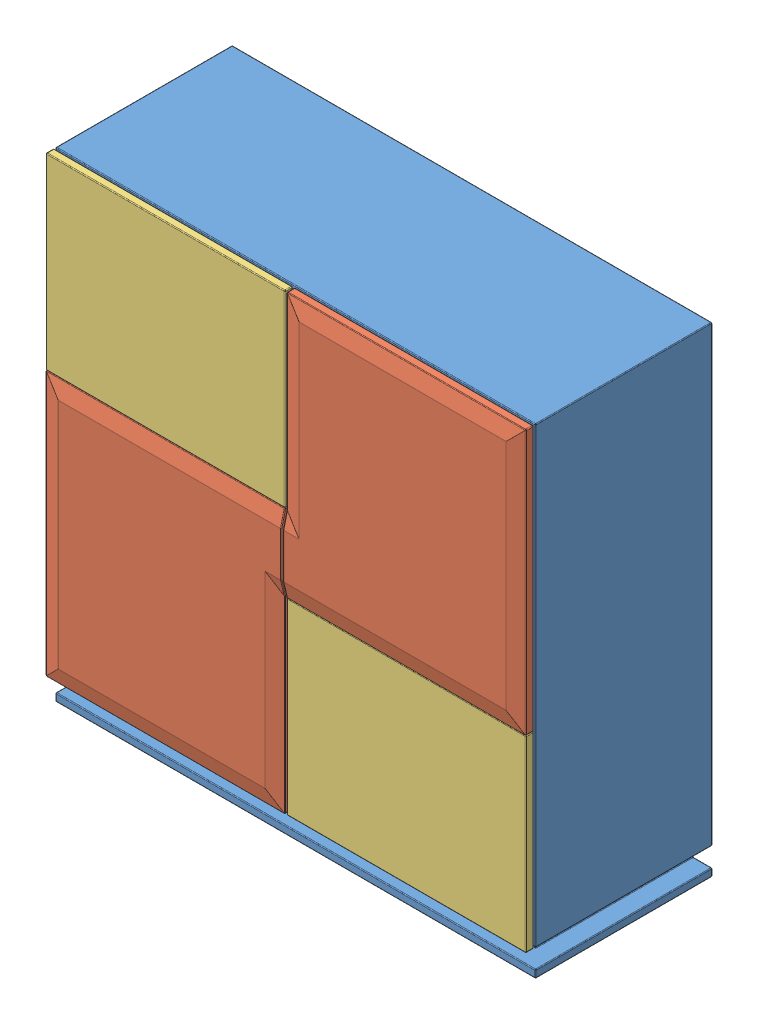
SolidWorks assembly Assemblage.SLDASM, configuration Défaut (file format 4400). Lengths in mm.
Overall size (1250 1250 495).
3 component instances, 3 part files, 6 mates.
Components (placement in the parent):
- Armoire Moderne (P1)-1: Armoire Moderne (P1).SLDPRT [Défaut] at (-28.7545 -658.6838 -2.5) size (1250 1250 465)
- Armoire Moderne (P2)-1: Armoire Moderne (P2).SLDPRT [Défaut] at (-28.7545 1.3162 232.5) size (1250 1180 30)
- Armoire Moderne (P3)-1: Armoire Moderne (P3).SLDPRT [Défaut] at (-26.2545 -588.6838 252.5) size (1250 1180 20)
Mates (geometry in assembly coordinates):
- Coïncidente1: coincident aligned: plane of Armoire Moderne (P1)-1 through (596.2455 591.3162 -232.5) normal (0 1 0); plane of Armoire Moderne (P2)-1 through (596.2455 591.3162 232.5) normal (0 1 0)
- Coïncidente2: coincident aligned: plane of Armoire Moderne (P1)-1 through (596.2455 -638.6838 227.5) normal (1 0 0); plane of Armoire Moderne (P2)-1 through (596.2455 591.3162 262.5) normal (1 0 0)
- Coïncidente3: coincident anti-aligned: plane of Armoire Moderne (P1)-1 through (21.2455 -538.6838 232.5) normal (0 0 1); plane of Armoire Moderne (P2)-1 through (596.2455 591.3162 232.5) normal (0 0 -1)
- Coïncidente4: coincident aligned: plane of Armoire Moderne (P1)-1 through (596.2455 591.3162 -232.5) normal (0 1 0); plane of Armoire Moderne (P3)-1 through (-31.2545 591.3162 232.5) normal (0 1 0)
- Coïncidente5: coincident anti-aligned: plane of Armoire Moderne (P1)-1 through (-603.7545 -538.6838 232.5) normal (0 0 1); plane of Armoire Moderne (P3)-1 through (-31.2545 591.3162 232.5) normal (0 0 -1)
- Coïncidente6: coincident aligned: plane of Armoire Moderne (P1)-1 through (-653.7545 -638.6838 227.5) normal (-1 0 0); plane of Armoire Moderne (P3)-1 through (-653.7545 101.3162 232.5) normal (-1 0 0)
